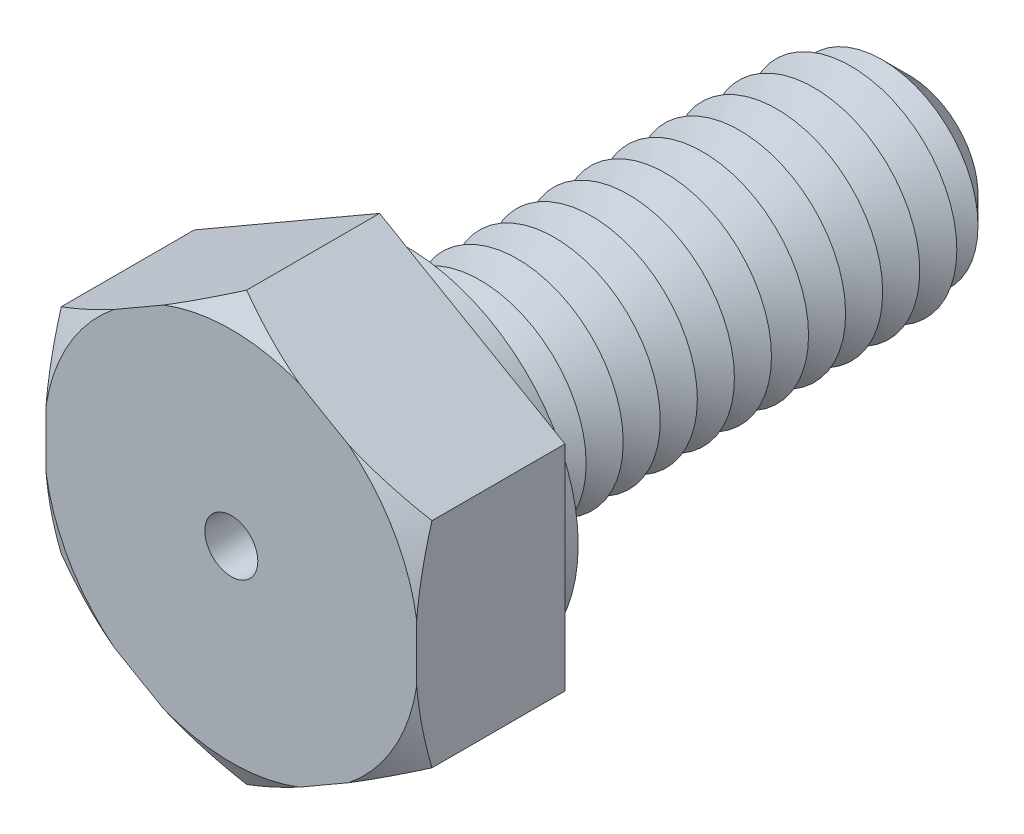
ISO-10303-21;
HEADER;
FILE_DESCRIPTION(('STEP AP214'),'2;1');
FILE_NAME('part.step','',(''),(''),'','','');
FILE_SCHEMA(('AUTOMOTIVE_DESIGN { 1 0 10303 214 1 1 1 1 }'));
ENDSEC;
DATA;
#1=APPLICATION_CONTEXT('core data for automotive mechanical design processes');
#2=APPLICATION_PROTOCOL_DEFINITION('international standard','automotive_design',2000,#1);
#3=PRODUCT_CONTEXT('',#1,'mechanical');
#4=PRODUCT('Part','Part','',(#3));
#5=PRODUCT_RELATED_PRODUCT_CATEGORY('part','',(#4));
#6=PRODUCT_DEFINITION_FORMATION('','',#4);
#7=PRODUCT_DEFINITION_CONTEXT('part definition',#1,'design');
#8=PRODUCT_DEFINITION('design','',#6,#7);
#9=PRODUCT_DEFINITION_SHAPE('','',#8);
#10=(LENGTH_UNIT() NAMED_UNIT(*) SI_UNIT(.MILLI.,.METRE.));
#11=(NAMED_UNIT(*) PLANE_ANGLE_UNIT() SI_UNIT($,.RADIAN.));
#12=(NAMED_UNIT(*) SI_UNIT($,.STERADIAN.) SOLID_ANGLE_UNIT());
#13=UNCERTAINTY_MEASURE_WITH_UNIT(LENGTH_MEASURE(1.E-05),#10,'distance_accuracy_value','');
#14=(GEOMETRIC_REPRESENTATION_CONTEXT(3) GLOBAL_UNCERTAINTY_ASSIGNED_CONTEXT((#13)) GLOBAL_UNIT_ASSIGNED_CONTEXT((#10,
#11,#12)) REPRESENTATION_CONTEXT('',''));
#15=CARTESIAN_POINT('',(0.,0.,0.));
#16=DIRECTION('',(0.,0.,1.));
#17=DIRECTION('',(1.,0.,0.));
#18=AXIS2_PLACEMENT_3D('',#15,#16,#17);
#19=CARTESIAN_POINT('',(3.5,2.02072594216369,2.8));
#20=DIRECTION('',(-0.5,-0.866025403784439,0.));
#21=DIRECTION('',(0.866025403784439,-0.5,0.));
#22=AXIS2_PLACEMENT_3D('',#19,#20,#21);
#23=PLANE('',#22);
#24=CARTESIAN_POINT('',(5.93124915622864,0.617043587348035,1.40176894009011));
#25=CARTESIAN_POINT('',(5.82127624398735,0.680536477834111,1.46111507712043));
#26=CARTESIAN_POINT('',(5.71104026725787,0.744181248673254,1.51982121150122));
#27=CARTESIAN_POINT('',(5.48993126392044,0.871838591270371,1.63565294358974));
#28=CARTESIAN_POINT('',(5.37905815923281,0.935851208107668,1.69277834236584));
#29=CARTESIAN_POINT('',(5.15623473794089,1.06449837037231,1.80531321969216));
#30=CARTESIAN_POINT('',(5.04428210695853,1.12913425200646,1.86071660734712));
#31=CARTESIAN_POINT('',(4.81953834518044,1.25889012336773,1.96920237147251));
#32=CARTESIAN_POINT('',(4.70674724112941,1.32401009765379,2.02228482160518));
#33=CARTESIAN_POINT('',(4.4773029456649,1.45647982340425,2.12693843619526));
#34=CARTESIAN_POINT('',(4.3606246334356,1.52384407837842,2.17843650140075));
#35=CARTESIAN_POINT('',(4.12610336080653,1.65924499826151,2.27776074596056));
#36=CARTESIAN_POINT('',(4.00826046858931,1.72728162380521,2.32558713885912));
#37=CARTESIAN_POINT('',(3.77136592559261,1.86405275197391,2.41666718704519));
#38=CARTESIAN_POINT('',(3.65231548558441,1.93278655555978,2.45992500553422));
#39=CARTESIAN_POINT('',(3.41281068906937,2.07106471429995,2.54086522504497));
#40=CARTESIAN_POINT('',(3.29235651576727,2.14060896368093,2.57854834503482));
#41=CARTESIAN_POINT('',(3.00433211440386,2.30689992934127,2.66006219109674));
#42=CARTESIAN_POINT('',(2.83610127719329,2.40402804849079,2.70086381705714));
#43=CARTESIAN_POINT('',(2.49725085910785,2.59966342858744,2.76622673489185));
#44=CARTESIAN_POINT('',(2.32663213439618,2.69817019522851,2.79079370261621));
#45=CARTESIAN_POINT('',(2.07079150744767,2.84587985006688,2.81342200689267));
#46=CARTESIAN_POINT('',(1.98601608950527,2.89482496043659,2.8186046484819));
#47=CARTESIAN_POINT('',(1.81634230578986,2.9927861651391,2.82423615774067));
#48=CARTESIAN_POINT('',(1.73144394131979,3.04180225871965,2.82468507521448));
#49=CARTESIAN_POINT('',(1.56172682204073,3.13978848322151,2.82082792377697));
#50=CARTESIAN_POINT('',(1.47690807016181,3.18875861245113,2.81652168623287));
#51=CARTESIAN_POINT('',(1.30753953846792,3.28654357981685,2.80328667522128));
#52=CARTESIAN_POINT('',(1.22298977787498,3.3353584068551,2.79435757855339));
#53=CARTESIAN_POINT('',(1.02330750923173,3.45064501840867,2.76803629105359));
#54=CARTESIAN_POINT('',(0.90836188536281,3.51700890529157,2.7487394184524));
#55=CARTESIAN_POINT('',(0.679569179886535,3.64910243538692,2.70286231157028));
#56=CARTESIAN_POINT('',(0.565722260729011,3.71483198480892,2.67628101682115));
#57=CARTESIAN_POINT('',(0.339141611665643,3.84564838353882,2.61683846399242));
#58=CARTESIAN_POINT('',(0.226409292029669,3.91073441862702,2.58397011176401));
#59=CARTESIAN_POINT('',(0.00220965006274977,4.04017614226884,2.512988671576));
#60=CARTESIAN_POINT('',(-0.109257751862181,4.10453187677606,2.47487591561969));
#61=CARTESIAN_POINT('',(-0.332327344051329,4.23332116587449,2.39383232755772));
#62=CARTESIAN_POINT('',(-0.443915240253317,4.29774646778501,2.35084938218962));
#63=CARTESIAN_POINT('',(-0.665905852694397,4.42591280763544,2.26126522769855));
#64=CARTESIAN_POINT('',(-0.776309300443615,4.48965426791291,2.2146664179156));
#65=CARTESIAN_POINT('',(-1.10600622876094,4.68000487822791,2.07044134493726));
#66=CARTESIAN_POINT('',(-1.32384189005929,4.80577235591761,1.96836549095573));
#67=CARTESIAN_POINT('',(-1.61545494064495,4.97413522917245,1.82536950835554));
#68=CARTESIAN_POINT('',(-1.69056073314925,5.01749757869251,1.78796601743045));
#69=CARTESIAN_POINT('',(-1.84044297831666,5.10403213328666,1.71229146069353));
#70=CARTESIAN_POINT('',(-1.91521944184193,5.14720434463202,1.67402042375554));
#71=CARTESIAN_POINT('',(-2.06368614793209,5.23292163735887,1.59712633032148));
#72=CARTESIAN_POINT('',(-2.13737951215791,5.27546852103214,1.55851128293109));
#73=CARTESIAN_POINT('',(-2.28450431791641,5.36041106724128,1.48061736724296));
#74=CARTESIAN_POINT('',(-2.35793575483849,5.40280672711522,1.44133848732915));
#75=CARTESIAN_POINT('',(-2.43124915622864,5.44513423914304,1.40176894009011));
#76=B_SPLINE_CURVE_WITH_KNOTS('',3,(#24,#25,#26,#27,#28,#29,#30,#31,#32,#33,#34,#35,#36,#37,#38,
#39,#40,#41,#42,#43,#44,#45,#46,#47,#48,#49,#50,#51,#52,#53,#54,#55,#56,#57,#58,#59,#60,#61,#62,
#63,#64,#65,#66,#67,#68,#69,#70,#71,#72,#73,#74,#75),.UNSPECIFIED.,.F.,.F.,(4,2,2,2,2,2,2,2,2,2,
2,2,2,2,2,2,2,2,2,2,2,2,2,2,2,4),(0.,0.420511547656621,0.841075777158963,1.26298883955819,
1.68488850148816,2.11755106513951,2.55018844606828,2.98242811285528,3.41461198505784,
4.0095520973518,4.60428410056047,4.89826759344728,5.19224799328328,5.48623881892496,
5.78025020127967,6.1823765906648,6.58456155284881,6.98720303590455,7.3898190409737,
7.7972442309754,8.20440134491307,9.01851321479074,9.30185450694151,9.58518638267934,
9.86552040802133,10.1458593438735),.UNSPECIFIED.);
#77=CARTESIAN_POINT('',(3.5,2.02072594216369,2.51132486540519));
#78=VERTEX_POINT('',#77);
#79=CARTESIAN_POINT('',(2.2178793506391,2.76095864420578,2.8));
#80=VERTEX_POINT('',#79);
#81=EDGE_CURVE('E132',#78,#80,#76,.T.);
#82=ORIENTED_EDGE('',*,*,#81,.F.);
#83=DIRECTION('',(0.,0.,-1.));
#84=VECTOR('',#83,1.);
#85=CARTESIAN_POINT('',(3.5,2.02072594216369,2.8));
#86=LINE('',#85,#84);
#87=CARTESIAN_POINT('',(3.5,2.02072594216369,0.));
#88=VERTEX_POINT('',#87);
#89=EDGE_CURVE('E144',#78,#88,#86,.T.);
#90=ORIENTED_EDGE('',*,*,#89,.T.);
#91=DIRECTION('',(-0.866025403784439,0.5,0.));
#92=VECTOR('',#91,1.);
#93=CARTESIAN_POINT('',(3.5,2.02072594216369,0.));
#94=LINE('',#93,#92);
#95=CARTESIAN_POINT('',(0.,4.04145188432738,0.));
#96=VERTEX_POINT('',#95);
#97=EDGE_CURVE('E307',#88,#96,#94,.T.);
#98=ORIENTED_EDGE('',*,*,#97,.T.);
#99=DIRECTION('',(0.,0.,-1.));
#100=VECTOR('',#99,1.);
#101=CARTESIAN_POINT('',(0.,4.04145188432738,2.8));
#102=LINE('',#101,#100);
#103=CARTESIAN_POINT('',(0.,4.04145188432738,2.51132486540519));
#104=VERTEX_POINT('',#103);
#105=EDGE_CURVE('E179',#104,#96,#102,.T.);
#106=ORIENTED_EDGE('',*,*,#105,.F.);
#107=CARTESIAN_POINT('',(1.2821206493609,3.30121918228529,2.8));
#108=VERTEX_POINT('',#107);
#109=EDGE_CURVE('E151',#108,#104,#76,.T.);
#110=ORIENTED_EDGE('',*,*,#109,.F.);
#111=DIRECTION('',(-0.866025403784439,0.5,0.));
#112=VECTOR('',#111,1.);
#113=CARTESIAN_POINT('',(3.5,2.02072594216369,2.8));
#114=LINE('',#113,#112);
#115=EDGE_CURVE('E148',#80,#108,#114,.T.);
#116=ORIENTED_EDGE('',*,*,#115,.F.);
#117=EDGE_LOOP('',(#82,#90,#98,#106,#110,#116));
#118=FACE_BOUND('',#117,.T.);
#119=ADVANCED_FACE('F39',(#118),#23,.F.);
#120=CARTESIAN_POINT('',(0.,4.04145188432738,2.8));
#121=DIRECTION('',(0.5,-0.866025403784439,0.));
#122=DIRECTION('',(0.866025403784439,0.5,0.));
#123=AXIS2_PLACEMENT_3D('',#120,#121,#122);
#124=PLANE('',#123);
#125=CARTESIAN_POINT('',(2.43124915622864,5.44513423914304,1.4017689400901));
#126=CARTESIAN_POINT('',(2.32127624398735,5.38164134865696,1.46111507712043));
#127=CARTESIAN_POINT('',(2.21104026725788,5.31799657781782,1.51982121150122));
#128=CARTESIAN_POINT('',(1.98993126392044,5.1903392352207,1.63565294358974));
#129=CARTESIAN_POINT('',(1.87905815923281,5.1263266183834,1.69277834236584));
#130=CARTESIAN_POINT('',(1.65623473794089,4.99767945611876,1.80531321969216));
#131=CARTESIAN_POINT('',(1.54428210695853,4.93304357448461,1.86071660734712));
#132=CARTESIAN_POINT('',(1.31953834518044,4.80328770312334,1.96920237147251));
#133=CARTESIAN_POINT('',(1.20674724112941,4.73816772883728,2.02228482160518));
#134=CARTESIAN_POINT('',(0.977302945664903,4.60569800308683,2.12693843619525));
#135=CARTESIAN_POINT('',(0.860624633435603,4.53833374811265,2.17843650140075));
#136=CARTESIAN_POINT('',(0.626103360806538,4.40293282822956,2.27776074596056));
#137=CARTESIAN_POINT('',(0.50826046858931,4.33489620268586,2.32558713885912));
#138=CARTESIAN_POINT('',(0.271365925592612,4.19812507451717,2.41666718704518));
#139=CARTESIAN_POINT('',(0.152315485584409,4.12939127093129,2.45992500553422));
#140=CARTESIAN_POINT('',(-0.0871893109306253,3.99111311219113,2.54086522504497));
#141=CARTESIAN_POINT('',(-0.207643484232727,3.92156886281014,2.57854834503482));
#142=CARTESIAN_POINT('',(-0.495667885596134,3.7552778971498,2.66006219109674));
#143=CARTESIAN_POINT('',(-0.663898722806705,3.65814977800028,2.70086381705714));
#144=CARTESIAN_POINT('',(-1.00274914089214,3.46251439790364,2.76622673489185));
#145=CARTESIAN_POINT('',(-1.17336786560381,3.36400763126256,2.79079370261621));
#146=CARTESIAN_POINT('',(-1.42920849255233,3.21629797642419,2.81342200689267));
#147=CARTESIAN_POINT('',(-1.51398391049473,3.16735286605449,2.8186046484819));
#148=CARTESIAN_POINT('',(-1.68365769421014,3.06939166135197,2.82423615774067));
#149=CARTESIAN_POINT('',(-1.7685560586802,3.02037556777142,2.82468507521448));
#150=CARTESIAN_POINT('',(-1.93827317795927,2.92238934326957,2.82082792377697));
#151=CARTESIAN_POINT('',(-2.02309192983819,2.87341921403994,2.81652168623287));
#152=CARTESIAN_POINT('',(-2.19246046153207,2.77563424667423,2.80328667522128));
#153=CARTESIAN_POINT('',(-2.27701022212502,2.72681941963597,2.79435757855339));
#154=CARTESIAN_POINT('',(-2.47669249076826,2.6115328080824,2.76803629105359));
#155=CARTESIAN_POINT('',(-2.59163811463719,2.54516892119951,2.7487394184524));
#156=CARTESIAN_POINT('',(-2.82043082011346,2.41307539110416,2.70286231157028));
#157=CARTESIAN_POINT('',(-2.93427773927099,2.34734584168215,2.67628101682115));
#158=CARTESIAN_POINT('',(-3.16085838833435,2.21652944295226,2.61683846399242));
#159=CARTESIAN_POINT('',(-3.27359070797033,2.15144340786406,2.58397011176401));
#160=CARTESIAN_POINT('',(-3.49779034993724,2.02200168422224,2.512988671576));
#161=CARTESIAN_POINT('',(-3.60925775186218,1.95764594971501,2.47487591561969));
#162=CARTESIAN_POINT('',(-3.83232734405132,1.82885666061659,2.39383232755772));
#163=CARTESIAN_POINT('',(-3.94391524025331,1.76443135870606,2.35084938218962));
#164=CARTESIAN_POINT('',(-4.16590585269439,1.63626501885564,2.26126522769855));
#165=CARTESIAN_POINT('',(-4.27630930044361,1.57252355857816,2.21466641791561));
#166=CARTESIAN_POINT('',(-4.60600622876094,1.38217294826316,2.07044134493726));
#167=CARTESIAN_POINT('',(-4.82384189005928,1.25640547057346,1.96836549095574));
#168=CARTESIAN_POINT('',(-5.11545494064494,1.08804259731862,1.82536950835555));
#169=CARTESIAN_POINT('',(-5.19056073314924,1.04468024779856,1.78796601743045));
#170=CARTESIAN_POINT('',(-5.34044297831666,0.958145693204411,1.71229146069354));
#171=CARTESIAN_POINT('',(-5.41521944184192,0.914973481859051,1.67402042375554));
#172=CARTESIAN_POINT('',(-5.56368614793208,0.829256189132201,1.59712633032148));
#173=CARTESIAN_POINT('',(-5.6373795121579,0.786709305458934,1.55851128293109));
#174=CARTESIAN_POINT('',(-5.78450431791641,0.701766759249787,1.48061736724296));
#175=CARTESIAN_POINT('',(-5.85793575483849,0.659371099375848,1.44133848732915));
#176=CARTESIAN_POINT('',(-5.93124915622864,0.617043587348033,1.40176894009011));
#177=B_SPLINE_CURVE_WITH_KNOTS('',3,(#125,#126,#127,#128,#129,#130,#131,#132,#133,#134,#135,
#136,#137,#138,#139,#140,#141,#142,#143,#144,#145,#146,#147,#148,#149,#150,#151,#152,#153,#154,
#155,#156,#157,#158,#159,#160,#161,#162,#163,#164,#165,#166,#167,#168,#169,#170,#171,#172,#173,
#174,#175,#176),.UNSPECIFIED.,.F.,.F.,(4,2,2,2,2,2,2,2,2,2,2,2,2,2,2,2,2,2,2,2,2,2,2,2,2,4),(0.,
0.420511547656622,0.841075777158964,1.26298883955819,1.68488850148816,2.11755106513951,
2.55018844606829,2.98242811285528,3.41461198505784,4.0095520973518,4.60428410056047,
4.89826759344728,5.19224799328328,5.48623881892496,5.78025020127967,6.1823765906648,
6.58456155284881,6.98720303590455,7.3898190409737,7.7972442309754,8.20440134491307,
9.01851321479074,9.30185450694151,9.58518638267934,9.86552040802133,10.1458593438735),.UNSPECIFIED.);
#178=CARTESIAN_POINT('',(-1.2821206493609,3.30121918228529,2.8));
#179=VERTEX_POINT('',#178);
#180=EDGE_CURVE('E899',#104,#179,#177,.T.);
#181=ORIENTED_EDGE('',*,*,#180,.F.);
#182=ORIENTED_EDGE('',*,*,#105,.T.);
#183=DIRECTION('',(-0.866025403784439,-0.5,0.));
#184=VECTOR('',#183,1.);
#185=CARTESIAN_POINT('',(0.,4.04145188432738,0.));
#186=LINE('',#185,#184);
#187=CARTESIAN_POINT('',(-3.5,2.02072594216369,0.));
#188=VERTEX_POINT('',#187);
#189=EDGE_CURVE('E326',#96,#188,#186,.T.);
#190=ORIENTED_EDGE('',*,*,#189,.T.);
#191=DIRECTION('',(0.,0.,-1.));
#192=VECTOR('',#191,1.);
#193=CARTESIAN_POINT('',(-3.5,2.02072594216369,2.8));
#194=LINE('',#193,#192);
#195=CARTESIAN_POINT('',(-3.5,2.02072594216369,2.51132486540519));
#196=VERTEX_POINT('',#195);
#197=EDGE_CURVE('E176',#196,#188,#194,.T.);
#198=ORIENTED_EDGE('',*,*,#197,.F.);
#199=CARTESIAN_POINT('',(-2.2178793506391,2.76095864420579,2.8));
#200=VERTEX_POINT('',#199);
#201=EDGE_CURVE('E394',#200,#196,#177,.T.);
#202=ORIENTED_EDGE('',*,*,#201,.F.);
#203=DIRECTION('',(-0.866025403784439,-0.5,0.));
#204=VECTOR('',#203,1.);
#205=CARTESIAN_POINT('',(0.,4.04145188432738,2.8));
#206=LINE('',#205,#204);
#207=EDGE_CURVE('E310',#179,#200,#206,.T.);
#208=ORIENTED_EDGE('',*,*,#207,.F.);
#209=EDGE_LOOP('',(#181,#182,#190,#198,#202,#208));
#210=FACE_BOUND('',#209,.T.);
#211=ADVANCED_FACE('F403',(#210),#124,.F.);
#212=CARTESIAN_POINT('',(-3.5,2.02072594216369,2.8));
#213=DIRECTION('',(1.,0.,0.));
#214=DIRECTION('',(0.,1.,0.));
#215=AXIS2_PLACEMENT_3D('',#212,#213,#214);
#216=PLANE('',#215);
#217=CARTESIAN_POINT('',(-3.5,4.45197509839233,1.57509745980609));
#218=CARTESIAN_POINT('',(-3.5,4.32552348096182,1.632476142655));
#219=CARTESIAN_POINT('',(-3.5,4.19872625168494,1.68910722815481));
#220=CARTESIAN_POINT('',(-3.5,3.94429210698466,1.80051165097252));
#221=CARTESIAN_POINT('',(-3.5,3.81665504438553,1.85528465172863));
#222=CARTESIAN_POINT('',(-3.5,3.55990351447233,1.96281335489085));
#223=CARTESIAN_POINT('',(-3.5,3.43078510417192,2.01555968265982));
#224=CARTESIAN_POINT('',(-3.5,3.17145843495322,2.11829034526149));
#225=CARTESIAN_POINT('',(-3.5,3.04125022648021,2.16827480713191));
#226=CARTESIAN_POINT('',(-3.5,2.78016103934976,2.26465408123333));
#227=CARTESIAN_POINT('',(-3.5,2.64928566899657,2.31106393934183));
#228=CARTESIAN_POINT('',(-3.5,2.38615329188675,2.39977727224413));
#229=CARTESIAN_POINT('',(-3.5,2.25389619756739,2.44208048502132));
#230=CARTESIAN_POINT('',(-3.5,1.85519063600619,2.56138283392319));
#231=CARTESIAN_POINT('',(-3.5,1.58637912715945,2.63093897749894));
#232=CARTESIAN_POINT('',(-3.5,1.11975855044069,2.72563856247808));
#233=CARTESIAN_POINT('',(-3.5,0.923391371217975,2.75778053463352));
#234=CARTESIAN_POINT('',(-3.5,0.528527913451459,2.80406409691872));
#235=CARTESIAN_POINT('',(-3.5,0.330032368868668,2.81821170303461));
#236=CARTESIAN_POINT('',(-3.5,-0.0672968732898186,2.82680706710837));
#237=CARTESIAN_POINT('',(-3.5,-0.266130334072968,2.82126532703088));
#238=CARTESIAN_POINT('',(-3.5,-0.662321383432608,2.79120496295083));
#239=CARTESIAN_POINT('',(-3.5,-0.859678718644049,2.76668315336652));
#240=CARTESIAN_POINT('',(-3.5,-1.34971804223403,2.68500356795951));
#241=CARTESIAN_POINT('',(-3.5,-1.64068160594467,2.61765497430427));
#242=CARTESIAN_POINT('',(-3.5,-2.07181303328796,2.497569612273));
#243=CARTESIAN_POINT('',(-3.5,-2.21482517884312,2.45429352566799));
#244=CARTESIAN_POINT('',(-3.5,-2.49919378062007,2.36258423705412));
#245=CARTESIAN_POINT('',(-3.5,-2.64055035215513,2.31415139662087));
#246=CARTESIAN_POINT('',(-3.5,-2.92337235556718,2.2125676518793));
#247=CARTESIAN_POINT('',(-3.5,-3.06482042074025,2.15936898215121));
#248=CARTESIAN_POINT('',(-3.5,-3.34639535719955,2.04956763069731));
#249=CARTESIAN_POINT('',(-3.5,-3.48652214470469,1.99296473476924));
#250=CARTESIAN_POINT('',(-3.5,-3.76476497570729,1.87738368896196));
#251=CARTESIAN_POINT('',(-3.5,-3.90288810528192,1.81842250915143));
#252=CARTESIAN_POINT('',(-3.5,-4.1781332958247,1.6982956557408));
#253=CARTESIAN_POINT('',(-3.5,-4.31525559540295,1.6371305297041));
#254=CARTESIAN_POINT('',(-3.5,-4.45197509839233,1.57509745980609));
#255=B_SPLINE_CURVE_WITH_KNOTS('',3,(#217,#218,#219,#220,#221,#222,#223,#224,#225,#226,#227,
#228,#229,#230,#231,#232,#233,#234,#235,#236,#237,#238,#239,#240,#241,#242,#243,#244,#245,#246,
#247,#248,#249,#250,#251,#252,#253,#254),.UNSPECIFIED.,.F.,.F.,(4,2,2,2,2,2,2,2,2,2,2,2,2,2,2,2,
2,2,4),(0.,0.416588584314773,0.83325222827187,1.251655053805,1.67003861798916,2.08655215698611,
2.50309225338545,3.3347974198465,3.93106101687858,4.52712521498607,5.12287153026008,
5.71871785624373,6.61272902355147,7.06093271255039,7.50910499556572,7.9624204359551,
8.41576442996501,8.86628772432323,9.31669984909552),.UNSPECIFIED.);
#256=CARTESIAN_POINT('',(-3.5,0.540260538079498,2.8));
#257=VERTEX_POINT('',#256);
#258=EDGE_CURVE('E393',#196,#257,#255,.T.);
#259=ORIENTED_EDGE('',*,*,#258,.F.);
#260=ORIENTED_EDGE('',*,*,#197,.T.);
#261=DIRECTION('',(0.,-1.,0.));
#262=VECTOR('',#261,1.);
#263=CARTESIAN_POINT('',(-3.5,2.02072594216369,0.));
#264=LINE('',#263,#262);
#265=CARTESIAN_POINT('',(-3.5,-2.02072594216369,0.));
#266=VERTEX_POINT('',#265);
#267=EDGE_CURVE('E330',#188,#266,#264,.T.);
#268=ORIENTED_EDGE('',*,*,#267,.T.);
#269=DIRECTION('',(0.,0.,-1.));
#270=VECTOR('',#269,1.);
#271=CARTESIAN_POINT('',(-3.5,-2.02072594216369,2.8));
#272=LINE('',#271,#270);
#273=CARTESIAN_POINT('',(-3.5,-2.02072594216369,2.51132486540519));
#274=VERTEX_POINT('',#273);
#275=EDGE_CURVE('E173',#274,#266,#272,.T.);
#276=ORIENTED_EDGE('',*,*,#275,.F.);
#277=CARTESIAN_POINT('',(-3.5,-0.540260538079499,2.8));
#278=VERTEX_POINT('',#277);
#279=EDGE_CURVE('E387',#278,#274,#255,.T.);
#280=ORIENTED_EDGE('',*,*,#279,.F.);
#281=DIRECTION('',(0.,-1.,0.));
#282=VECTOR('',#281,1.);
#283=CARTESIAN_POINT('',(-3.5,2.02072594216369,2.8));
#284=LINE('',#283,#282);
#285=EDGE_CURVE('E314',#257,#278,#284,.T.);
#286=ORIENTED_EDGE('',*,*,#285,.F.);
#287=EDGE_LOOP('',(#259,#260,#268,#276,#280,#286));
#288=FACE_BOUND('',#287,.T.);
#289=ADVANCED_FACE('F399',(#288),#216,.F.);
#290=CARTESIAN_POINT('',(-3.5,-2.02072594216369,2.8));
#291=DIRECTION('',(0.5,0.866025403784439,0.));
#292=DIRECTION('',(-0.866025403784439,0.5,0.));
#293=AXIS2_PLACEMENT_3D('',#290,#291,#292);
#294=PLANE('',#293);
#295=CARTESIAN_POINT('',(-5.93124915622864,-0.617043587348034,1.4017689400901));
#296=CARTESIAN_POINT('',(-5.82127624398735,-0.68053647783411,1.46111507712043));
#297=CARTESIAN_POINT('',(-5.71104026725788,-0.744181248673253,1.51982121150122));
#298=CARTESIAN_POINT('',(-5.48993126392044,-0.87183859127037,1.63565294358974));
#299=CARTESIAN_POINT('',(-5.37905815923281,-0.935851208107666,1.69277834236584));
#300=CARTESIAN_POINT('',(-5.15623473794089,-1.06449837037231,1.80531321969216));
#301=CARTESIAN_POINT('',(-5.04428210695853,-1.12913425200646,1.86071660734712));
#302=CARTESIAN_POINT('',(-4.81953834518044,-1.25889012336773,1.96920237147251));
#303=CARTESIAN_POINT('',(-4.70674724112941,-1.32401009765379,2.02228482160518));
#304=CARTESIAN_POINT('',(-4.4773029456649,-1.45647982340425,2.12693843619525));
#305=CARTESIAN_POINT('',(-4.3606246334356,-1.52384407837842,2.17843650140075));
#306=CARTESIAN_POINT('',(-4.12610336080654,-1.65924499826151,2.27776074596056));
#307=CARTESIAN_POINT('',(-4.00826046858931,-1.72728162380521,2.32558713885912));
#308=CARTESIAN_POINT('',(-3.77136592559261,-1.8640527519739,2.41666718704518));
#309=CARTESIAN_POINT('',(-3.65231548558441,-1.93278655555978,2.45992500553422));
#310=CARTESIAN_POINT('',(-3.41281068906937,-2.07106471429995,2.54086522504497));
#311=CARTESIAN_POINT('',(-3.29235651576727,-2.14060896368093,2.57854834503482));
#312=CARTESIAN_POINT('',(-3.00433211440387,-2.30689992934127,2.66006219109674));
#313=CARTESIAN_POINT('',(-2.83610127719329,-2.40402804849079,2.70086381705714));
#314=CARTESIAN_POINT('',(-2.49725085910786,-2.59966342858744,2.76622673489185));
#315=CARTESIAN_POINT('',(-2.32663213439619,-2.69817019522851,2.79079370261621));
#316=CARTESIAN_POINT('',(-2.07079150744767,-2.84587985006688,2.81342200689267));
#317=CARTESIAN_POINT('',(-1.98601608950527,-2.89482496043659,2.8186046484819));
#318=CARTESIAN_POINT('',(-1.81634230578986,-2.9927861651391,2.82423615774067));
#319=CARTESIAN_POINT('',(-1.7314439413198,-3.04180225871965,2.82468507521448));
#320=CARTESIAN_POINT('',(-1.56172682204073,-3.13978848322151,2.82082792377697));
#321=CARTESIAN_POINT('',(-1.47690807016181,-3.18875861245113,2.81652168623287));
#322=CARTESIAN_POINT('',(-1.30753953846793,-3.28654357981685,2.80328667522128));
#323=CARTESIAN_POINT('',(-1.22298977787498,-3.3353584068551,2.79435757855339));
#324=CARTESIAN_POINT('',(-1.02330750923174,-3.45064501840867,2.76803629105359));
#325=CARTESIAN_POINT('',(-0.908361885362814,-3.51700890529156,2.7487394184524));
#326=CARTESIAN_POINT('',(-0.679569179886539,-3.64910243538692,2.70286231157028));
#327=CARTESIAN_POINT('',(-0.565722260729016,-3.71483198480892,2.67628101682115));
#328=CARTESIAN_POINT('',(-0.339141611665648,-3.84564838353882,2.61683846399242));
#329=CARTESIAN_POINT('',(-0.226409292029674,-3.91073441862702,2.58397011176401));
#330=CARTESIAN_POINT('',(-0.00220965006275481,-4.04017614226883,2.512988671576));
#331=CARTESIAN_POINT('',(0.109257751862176,-4.10453187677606,2.47487591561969));
#332=CARTESIAN_POINT('',(0.332327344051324,-4.23332116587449,2.39383232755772));
#333=CARTESIAN_POINT('',(0.443915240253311,-4.29774646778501,2.35084938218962));
#334=CARTESIAN_POINT('',(0.665905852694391,-4.42591280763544,2.26126522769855));
#335=CARTESIAN_POINT('',(0.776309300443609,-4.48965426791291,2.2146664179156));
#336=CARTESIAN_POINT('',(1.10600622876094,-4.68000487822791,2.07044134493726));
#337=CARTESIAN_POINT('',(1.32384189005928,-4.80577235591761,1.96836549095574));
#338=CARTESIAN_POINT('',(1.61545494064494,-4.97413522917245,1.82536950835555));
#339=CARTESIAN_POINT('',(1.69056073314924,-5.01749757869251,1.78796601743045));
#340=CARTESIAN_POINT('',(1.84044297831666,-5.10403213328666,1.71229146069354));
#341=CARTESIAN_POINT('',(1.91521944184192,-5.14720434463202,1.67402042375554));
#342=CARTESIAN_POINT('',(2.06368614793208,-5.23292163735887,1.59712633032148));
#343=CARTESIAN_POINT('',(2.1373795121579,-5.27546852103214,1.55851128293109));
#344=CARTESIAN_POINT('',(2.28450431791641,-5.36041106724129,1.48061736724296));
#345=CARTESIAN_POINT('',(2.35793575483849,-5.40280672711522,1.44133848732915));
#346=CARTESIAN_POINT('',(2.43124915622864,-5.44513423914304,1.40176894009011));
#347=B_SPLINE_CURVE_WITH_KNOTS('',3,(#295,#296,#297,#298,#299,#300,#301,#302,#303,#304,#305,
#306,#307,#308,#309,#310,#311,#312,#313,#314,#315,#316,#317,#318,#319,#320,#321,#322,#323,#324,
#325,#326,#327,#328,#329,#330,#331,#332,#333,#334,#335,#336,#337,#338,#339,#340,#341,#342,#343,
#344,#345,#346),.UNSPECIFIED.,.F.,.F.,(4,2,2,2,2,2,2,2,2,2,2,2,2,2,2,2,2,2,2,2,2,2,2,2,2,4),(0.,
0.420511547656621,0.841075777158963,1.26298883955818,1.68488850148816,2.11755106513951,
2.55018844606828,2.98242811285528,3.41461198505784,4.00955209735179,4.60428410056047,
4.89826759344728,5.19224799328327,5.48623881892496,5.78025020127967,6.1823765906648,
6.58456155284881,6.98720303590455,7.38981904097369,7.7972442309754,8.20440134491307,
9.01851321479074,9.30185450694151,9.58518638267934,9.86552040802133,10.1458593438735),.UNSPECIFIED.);
#348=CARTESIAN_POINT('',(-2.2178793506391,-2.76095864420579,2.8));
#349=VERTEX_POINT('',#348);
#350=EDGE_CURVE('E346',#274,#349,#347,.T.);
#351=ORIENTED_EDGE('',*,*,#350,.F.);
#352=ORIENTED_EDGE('',*,*,#275,.T.);
#353=DIRECTION('',(0.866025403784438,-0.5,0.));
#354=VECTOR('',#353,1.);
#355=CARTESIAN_POINT('',(-3.5,-2.02072594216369,0.));
#356=LINE('',#355,#354);
#357=CARTESIAN_POINT('',(0.,-4.04145188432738,0.));
#358=VERTEX_POINT('',#357);
#359=EDGE_CURVE('E334',#266,#358,#356,.T.);
#360=ORIENTED_EDGE('',*,*,#359,.T.);
#361=DIRECTION('',(0.,0.,-1.));
#362=VECTOR('',#361,1.);
#363=CARTESIAN_POINT('',(0.,-4.04145188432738,2.8));
#364=LINE('',#363,#362);
#365=CARTESIAN_POINT('',(0.,-4.04145188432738,2.51132486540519));
#366=VERTEX_POINT('',#365);
#367=EDGE_CURVE('E163',#366,#358,#364,.T.);
#368=ORIENTED_EDGE('',*,*,#367,.F.);
#369=CARTESIAN_POINT('',(-1.2821206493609,-3.30121918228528,2.8));
#370=VERTEX_POINT('',#369);
#371=EDGE_CURVE('E345',#370,#366,#347,.T.);
#372=ORIENTED_EDGE('',*,*,#371,.F.);
#373=DIRECTION('',(0.866025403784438,-0.5,0.));
#374=VECTOR('',#373,1.);
#375=CARTESIAN_POINT('',(-3.5,-2.02072594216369,2.8));
#376=LINE('',#375,#374);
#377=EDGE_CURVE('E318',#349,#370,#376,.T.);
#378=ORIENTED_EDGE('',*,*,#377,.F.);
#379=EDGE_LOOP('',(#351,#352,#360,#368,#372,#378));
#380=FACE_BOUND('',#379,.T.);
#381=ADVANCED_FACE('F402',(#380),#294,.F.);
#382=CARTESIAN_POINT('',(0.,-4.04145188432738,2.8));
#383=DIRECTION('',(-0.5,0.866025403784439,0.));
#384=DIRECTION('',(-0.866025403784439,-0.5,0.));
#385=AXIS2_PLACEMENT_3D('',#382,#383,#384);
#386=PLANE('',#385);
#387=CARTESIAN_POINT('',(-2.43124915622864,-5.44513423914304,1.4017689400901));
#388=CARTESIAN_POINT('',(-2.32127624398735,-5.38164134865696,1.46111507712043));
#389=CARTESIAN_POINT('',(-2.21104026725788,-5.31799657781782,1.51982121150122));
#390=CARTESIAN_POINT('',(-1.98993126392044,-5.1903392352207,1.63565294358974));
#391=CARTESIAN_POINT('',(-1.87905815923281,-5.1263266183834,1.69277834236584));
#392=CARTESIAN_POINT('',(-1.65623473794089,-4.99767945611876,1.80531321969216));
#393=CARTESIAN_POINT('',(-1.54428210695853,-4.93304357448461,1.86071660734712));
#394=CARTESIAN_POINT('',(-1.31953834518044,-4.80328770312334,1.96920237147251));
#395=CARTESIAN_POINT('',(-1.20674724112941,-4.73816772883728,2.02228482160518));
#396=CARTESIAN_POINT('',(-0.977302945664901,-4.60569800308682,2.12693843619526));
#397=CARTESIAN_POINT('',(-0.860624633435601,-4.53833374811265,2.17843650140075));
#398=CARTESIAN_POINT('',(-0.626103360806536,-4.40293282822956,2.27776074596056));
#399=CARTESIAN_POINT('',(-0.508260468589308,-4.33489620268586,2.32558713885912));
#400=CARTESIAN_POINT('',(-0.27136592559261,-4.19812507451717,2.41666718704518));
#401=CARTESIAN_POINT('',(-0.152315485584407,-4.12939127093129,2.45992500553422));
#402=CARTESIAN_POINT('',(0.0871893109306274,-3.99111311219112,2.54086522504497));
#403=CARTESIAN_POINT('',(0.20764348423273,-3.92156886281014,2.57854834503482));
#404=CARTESIAN_POINT('',(0.495667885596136,-3.7552778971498,2.66006219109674));
#405=CARTESIAN_POINT('',(0.663898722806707,-3.65814977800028,2.70086381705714));
#406=CARTESIAN_POINT('',(1.00274914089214,-3.46251439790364,2.76622673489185));
#407=CARTESIAN_POINT('',(1.17336786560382,-3.36400763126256,2.79079370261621));
#408=CARTESIAN_POINT('',(1.42920849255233,-3.21629797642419,2.81342200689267));
#409=CARTESIAN_POINT('',(1.51398391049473,-3.16735286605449,2.8186046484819));
#410=CARTESIAN_POINT('',(1.68365769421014,-3.06939166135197,2.82423615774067));
#411=CARTESIAN_POINT('',(1.76855605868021,-3.02037556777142,2.82468507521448));
#412=CARTESIAN_POINT('',(1.93827317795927,-2.92238934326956,2.82082792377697));
#413=CARTESIAN_POINT('',(2.02309192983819,-2.87341921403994,2.81652168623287));
#414=CARTESIAN_POINT('',(2.19246046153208,-2.77563424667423,2.80328667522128));
#415=CARTESIAN_POINT('',(2.27701022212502,-2.72681941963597,2.79435757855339));
#416=CARTESIAN_POINT('',(2.47669249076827,-2.6115328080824,2.76803629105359));
#417=CARTESIAN_POINT('',(2.59163811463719,-2.54516892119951,2.7487394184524));
#418=CARTESIAN_POINT('',(2.82043082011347,-2.41307539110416,2.70286231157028));
#419=CARTESIAN_POINT('',(2.93427773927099,-2.34734584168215,2.67628101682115));
#420=CARTESIAN_POINT('',(3.16085838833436,-2.21652944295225,2.61683846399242));
#421=CARTESIAN_POINT('',(3.27359070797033,-2.15144340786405,2.58397011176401));
#422=CARTESIAN_POINT('',(3.49779034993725,-2.02200168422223,2.512988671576));
#423=CARTESIAN_POINT('',(3.60925775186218,-1.95764594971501,2.47487591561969));
#424=CARTESIAN_POINT('',(3.83232734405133,-1.82885666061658,2.39383232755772));
#425=CARTESIAN_POINT('',(3.94391524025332,-1.76443135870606,2.35084938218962));
#426=CARTESIAN_POINT('',(4.1659058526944,-1.63626501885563,2.26126522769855));
#427=CARTESIAN_POINT('',(4.27630930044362,-1.57252355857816,2.2146664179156));
#428=CARTESIAN_POINT('',(4.60600622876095,-1.38217294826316,2.07044134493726));
#429=CARTESIAN_POINT('',(4.82384189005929,-1.25640547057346,1.96836549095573));
#430=CARTESIAN_POINT('',(5.11545494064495,-1.08804259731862,1.82536950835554));
#431=CARTESIAN_POINT('',(5.19056073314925,-1.04468024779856,1.78796601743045));
#432=CARTESIAN_POINT('',(5.34044297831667,-0.95814569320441,1.71229146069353));
#433=CARTESIAN_POINT('',(5.41521944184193,-0.914973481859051,1.67402042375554));
#434=CARTESIAN_POINT('',(5.56368614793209,-0.829256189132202,1.59712633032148));
#435=CARTESIAN_POINT('',(5.63737951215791,-0.786709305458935,1.55851128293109));
#436=CARTESIAN_POINT('',(5.78450431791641,-0.70176675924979,1.48061736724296));
#437=CARTESIAN_POINT('',(5.85793575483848,-0.659371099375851,1.44133848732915));
#438=CARTESIAN_POINT('',(5.93124915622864,-0.617043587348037,1.40176894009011));
#439=B_SPLINE_CURVE_WITH_KNOTS('',3,(#387,#388,#389,#390,#391,#392,#393,#394,#395,#396,#397,
#398,#399,#400,#401,#402,#403,#404,#405,#406,#407,#408,#409,#410,#411,#412,#413,#414,#415,#416,
#417,#418,#419,#420,#421,#422,#423,#424,#425,#426,#427,#428,#429,#430,#431,#432,#433,#434,#435,
#436,#437,#438),.UNSPECIFIED.,.F.,.F.,(4,2,2,2,2,2,2,2,2,2,2,2,2,2,2,2,2,2,2,2,2,2,2,2,2,4),(0.,
0.420511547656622,0.841075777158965,1.26298883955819,1.68488850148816,2.11755106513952,
2.55018844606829,2.98242811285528,3.41461198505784,4.0095520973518,4.60428410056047,
4.89826759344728,5.19224799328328,5.48623881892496,5.78025020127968,6.18237659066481,
6.58456155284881,6.98720303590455,7.3898190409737,7.79724423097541,8.20440134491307,
9.01851321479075,9.30185450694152,9.58518638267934,9.86552040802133,10.1458593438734),.UNSPECIFIED.);
#440=CARTESIAN_POINT('',(1.2821206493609,-3.30121918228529,2.8));
#441=VERTEX_POINT('',#440);
#442=EDGE_CURVE('E64',#366,#441,#439,.T.);
#443=ORIENTED_EDGE('',*,*,#442,.F.);
#444=ORIENTED_EDGE('',*,*,#367,.T.);
#445=DIRECTION('',(0.866025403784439,0.5,0.));
#446=VECTOR('',#445,1.);
#447=CARTESIAN_POINT('',(0.,-4.04145188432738,0.));
#448=LINE('',#447,#446);
#449=CARTESIAN_POINT('',(3.5,-2.02072594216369,0.));
#450=VERTEX_POINT('',#449);
#451=EDGE_CURVE('E337',#358,#450,#448,.T.);
#452=ORIENTED_EDGE('',*,*,#451,.T.);
#453=DIRECTION('',(0.,0.,-1.));
#454=VECTOR('',#453,1.);
#455=CARTESIAN_POINT('',(3.5,-2.02072594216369,2.8));
#456=LINE('',#455,#454);
#457=CARTESIAN_POINT('',(3.5,-2.02072594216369,2.51132486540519));
#458=VERTEX_POINT('',#457);
#459=EDGE_CURVE('E157',#458,#450,#456,.T.);
#460=ORIENTED_EDGE('',*,*,#459,.F.);
#461=CARTESIAN_POINT('',(2.2178793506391,-2.76095864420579,2.8));
#462=VERTEX_POINT('',#461);
#463=EDGE_CURVE('E348',#462,#458,#439,.T.);
#464=ORIENTED_EDGE('',*,*,#463,.F.);
#465=DIRECTION('',(0.866025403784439,0.5,0.));
#466=VECTOR('',#465,1.);
#467=CARTESIAN_POINT('',(0.,-4.04145188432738,2.8));
#468=LINE('',#467,#466);
#469=EDGE_CURVE('E166',#441,#462,#468,.T.);
#470=ORIENTED_EDGE('',*,*,#469,.F.);
#471=EDGE_LOOP('',(#443,#444,#452,#460,#464,#470));
#472=FACE_BOUND('',#471,.T.);
#473=ADVANCED_FACE('F424',(#472),#386,.F.);
#474=CARTESIAN_POINT('',(3.5,-2.02072594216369,2.8));
#475=DIRECTION('',(-1.,0.,0.));
#476=DIRECTION('',(0.,-1.,0.));
#477=AXIS2_PLACEMENT_3D('',#474,#475,#476);
#478=PLANE('',#477);
#479=CARTESIAN_POINT('',(3.5,-4.45197509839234,1.57509745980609));
#480=CARTESIAN_POINT('',(3.5,-4.32552348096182,1.632476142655));
#481=CARTESIAN_POINT('',(3.5,-4.19872625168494,1.68910722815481));
#482=CARTESIAN_POINT('',(3.5,-3.94429210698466,1.80051165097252));
#483=CARTESIAN_POINT('',(3.5,-3.81665504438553,1.85528465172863));
#484=CARTESIAN_POINT('',(3.5,-3.55990351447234,1.96281335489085));
#485=CARTESIAN_POINT('',(3.5,-3.43078510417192,2.01555968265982));
#486=CARTESIAN_POINT('',(3.5,-3.17145843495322,2.11829034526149));
#487=CARTESIAN_POINT('',(3.5,-3.04125022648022,2.16827480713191));
#488=CARTESIAN_POINT('',(3.5,-2.78016103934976,2.26465408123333));
#489=CARTESIAN_POINT('',(3.5,-2.64928566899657,2.31106393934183));
#490=CARTESIAN_POINT('',(3.5,-2.38615329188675,2.39977727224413));
#491=CARTESIAN_POINT('',(3.5,-2.25389619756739,2.44208048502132));
#492=CARTESIAN_POINT('',(3.5,-1.85519063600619,2.56138283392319));
#493=CARTESIAN_POINT('',(3.5,-1.58637912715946,2.63093897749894));
#494=CARTESIAN_POINT('',(3.5,-1.11975855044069,2.72563856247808));
#495=CARTESIAN_POINT('',(3.5,-0.923391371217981,2.75778053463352));
#496=CARTESIAN_POINT('',(3.5,-0.528527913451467,2.80406409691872));
#497=CARTESIAN_POINT('',(3.5,-0.330032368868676,2.81821170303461));
#498=CARTESIAN_POINT('',(3.5,0.0672968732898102,2.82680706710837));
#499=CARTESIAN_POINT('',(3.5,0.26613033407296,2.82126532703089));
#500=CARTESIAN_POINT('',(3.5,0.662321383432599,2.79120496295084));
#501=CARTESIAN_POINT('',(3.5,0.85967871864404,2.76668315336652));
#502=CARTESIAN_POINT('',(3.5,1.34971804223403,2.68500356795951));
#503=CARTESIAN_POINT('',(3.5,1.64068160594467,2.61765497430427));
#504=CARTESIAN_POINT('',(3.5,2.07181303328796,2.497569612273));
#505=CARTESIAN_POINT('',(3.5,2.21482517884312,2.45429352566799));
#506=CARTESIAN_POINT('',(3.5,2.49919378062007,2.36258423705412));
#507=CARTESIAN_POINT('',(3.5,2.64055035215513,2.31415139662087));
#508=CARTESIAN_POINT('',(3.5,2.92337235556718,2.2125676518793));
#509=CARTESIAN_POINT('',(3.5,3.06482042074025,2.15936898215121));
#510=CARTESIAN_POINT('',(3.5,3.34639535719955,2.04956763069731));
#511=CARTESIAN_POINT('',(3.5,3.48652214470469,1.99296473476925));
#512=CARTESIAN_POINT('',(3.5,3.76476497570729,1.87738368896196));
#513=CARTESIAN_POINT('',(3.5,3.90288810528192,1.81842250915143));
#514=CARTESIAN_POINT('',(3.5,4.1781332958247,1.6982956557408));
#515=CARTESIAN_POINT('',(3.5,4.31525559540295,1.6371305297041));
#516=CARTESIAN_POINT('',(3.5,4.45197509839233,1.57509745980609));
#517=B_SPLINE_CURVE_WITH_KNOTS('',3,(#479,#480,#481,#482,#483,#484,#485,#486,#487,#488,#489,
#490,#491,#492,#493,#494,#495,#496,#497,#498,#499,#500,#501,#502,#503,#504,#505,#506,#507,#508,
#509,#510,#511,#512,#513,#514,#515,#516),.UNSPECIFIED.,.F.,.F.,(4,2,2,2,2,2,2,2,2,2,2,2,2,2,2,2,
2,2,4),(0.,0.416588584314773,0.83325222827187,1.251655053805,1.67003861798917,2.08655215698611,
2.50309225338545,3.33479741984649,3.93106101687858,4.52712521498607,5.12287153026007,
5.71871785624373,6.61272902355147,7.0609327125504,7.50910499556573,7.96242043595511,
8.41576442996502,8.86628772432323,9.31669984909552),.UNSPECIFIED.);
#518=CARTESIAN_POINT('',(3.5,-0.540260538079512,2.8));
#519=VERTEX_POINT('',#518);
#520=EDGE_CURVE('E56',#458,#519,#517,.T.);
#521=ORIENTED_EDGE('',*,*,#520,.F.);
#522=ORIENTED_EDGE('',*,*,#459,.T.);
#523=DIRECTION('',(0.,1.,0.));
#524=VECTOR('',#523,1.);
#525=CARTESIAN_POINT('',(3.5,-2.02072594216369,0.));
#526=LINE('',#525,#524);
#527=EDGE_CURVE('E154',#450,#88,#526,.T.);
#528=ORIENTED_EDGE('',*,*,#527,.T.);
#529=ORIENTED_EDGE('',*,*,#89,.F.);
#530=CARTESIAN_POINT('',(3.5,0.540260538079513,2.8));
#531=VERTEX_POINT('',#530);
#532=EDGE_CURVE('E129',#531,#78,#517,.T.);
#533=ORIENTED_EDGE('',*,*,#532,.F.);
#534=DIRECTION('',(0.,1.,0.));
#535=VECTOR('',#534,1.);
#536=CARTESIAN_POINT('',(3.5,-2.02072594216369,2.8));
#537=LINE('',#536,#535);
#538=EDGE_CURVE('E158',#519,#531,#537,.T.);
#539=ORIENTED_EDGE('',*,*,#538,.F.);
#540=EDGE_LOOP('',(#521,#522,#528,#529,#533,#539));
#541=FACE_BOUND('',#540,.T.);
#542=ADVANCED_FACE('F152',(#541),#478,.F.);
#543=CARTESIAN_POINT('',(0.,0.,2.8));
#544=DIRECTION('',(0.,0.,1.));
#545=DIRECTION('',(1.,0.,0.));
#546=AXIS2_PLACEMENT_3D('',#543,#544,#545);
#547=PLANE('',#546);
#548=CARTESIAN_POINT('',(0.,0.,2.8));
#549=DIRECTION('',(0.,0.,1.));
#550=DIRECTION('',(1.,0.,0.));
#551=AXIS2_PLACEMENT_3D('',#548,#549,#550);
#552=CIRCLE('',#551,0.5);
#553=CARTESIAN_POINT('',(0.5,0.,2.8));
#554=VERTEX_POINT('',#553);
#555=EDGE_CURVE('E867',#554,#554,#552,.T.);
#556=ORIENTED_EDGE('',*,*,#555,.F.);
#557=EDGE_LOOP('',(#556));
#558=FACE_BOUND('',#557,.T.);
#559=ORIENTED_EDGE('',*,*,#538,.T.);
#560=CARTESIAN_POINT('',(0.,0.,2.8));
#561=DIRECTION('',(0.,0.,1.));
#562=DIRECTION('',(1.,0.,0.));
#563=AXIS2_PLACEMENT_3D('',#560,#561,#562);
#564=CIRCLE('',#563,3.54145188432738);
#565=EDGE_CURVE('E134',#531,#80,#564,.T.);
#566=ORIENTED_EDGE('',*,*,#565,.T.);
#567=ORIENTED_EDGE('',*,*,#115,.T.);
#568=CARTESIAN_POINT('',(0.,0.,2.8));
#569=DIRECTION('',(0.,0.,1.));
#570=DIRECTION('',(1.,0.,0.));
#571=AXIS2_PLACEMENT_3D('',#568,#569,#570);
#572=CIRCLE('',#571,3.54145188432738);
#573=EDGE_CURVE('E11',#108,#179,#572,.T.);
#574=ORIENTED_EDGE('',*,*,#573,.T.);
#575=ORIENTED_EDGE('',*,*,#207,.T.);
#576=EDGE_CURVE('E49',#200,#257,#572,.T.);
#577=ORIENTED_EDGE('',*,*,#576,.T.);
#578=ORIENTED_EDGE('',*,*,#285,.T.);
#579=EDGE_CURVE('E880',#278,#349,#572,.T.);
#580=ORIENTED_EDGE('',*,*,#579,.T.);
#581=ORIENTED_EDGE('',*,*,#377,.T.);
#582=EDGE_CURVE('E877',#370,#441,#572,.T.);
#583=ORIENTED_EDGE('',*,*,#582,.T.);
#584=ORIENTED_EDGE('',*,*,#469,.T.);
#585=EDGE_CURVE('E43',#462,#519,#572,.T.);
#586=ORIENTED_EDGE('',*,*,#585,.T.);
#587=EDGE_LOOP('',(#559,#566,#567,#574,#575,#577,#578,#580,#581,#583,#584,#586));
#588=FACE_BOUND('',#587,.T.);
#589=ADVANCED_FACE('F434',(#558,#588),#547,.T.);
#590=CARTESIAN_POINT('',(0.,0.,0.));
#591=DIRECTION('',(0.,0.,1.));
#592=DIRECTION('',(1.,0.,0.));
#593=AXIS2_PLACEMENT_3D('',#590,#591,#592);
#594=PLANE('',#593);
#595=CARTESIAN_POINT('',(0.,0.,0.));
#596=DIRECTION('',(0.,0.,1.));
#597=DIRECTION('',(1.,0.,0.));
#598=AXIS2_PLACEMENT_3D('',#595,#596,#597);
#599=CIRCLE('',#598,3.25);
#600=CARTESIAN_POINT('',(3.25,0.,0.));
#601=VERTEX_POINT('',#600);
#602=EDGE_CURVE('E182',#601,#601,#599,.F.);
#603=ORIENTED_EDGE('',*,*,#602,.F.);
#604=EDGE_LOOP('',(#603));
#605=FACE_BOUND('',#604,.T.);
#606=ORIENTED_EDGE('',*,*,#97,.F.);
#607=ORIENTED_EDGE('',*,*,#527,.F.);
#608=ORIENTED_EDGE('',*,*,#451,.F.);
#609=ORIENTED_EDGE('',*,*,#359,.F.);
#610=ORIENTED_EDGE('',*,*,#267,.F.);
#611=ORIENTED_EDGE('',*,*,#189,.F.);
#612=EDGE_LOOP('',(#606,#607,#608,#609,#610,#611));
#613=FACE_BOUND('',#612,.T.);
#614=ADVANCED_FACE('F439',(#605,#613),#594,.F.);
#615=CARTESIAN_POINT('',(0.,0.,-0.5));
#616=DIRECTION('',(0.,0.,1.));
#617=DIRECTION('',(1.,0.,0.));
#618=AXIS2_PLACEMENT_3D('',#615,#616,#617);
#619=CYLINDRICAL_SURFACE('',#618,3.25);
#620=CARTESIAN_POINT('',(0.,0.,-0.5));
#621=DIRECTION('',(0.,0.,-1.));
#622=DIRECTION('',(-1.,0.,0.));
#623=AXIS2_PLACEMENT_3D('',#620,#621,#622);
#624=CIRCLE('',#623,3.25);
#625=CARTESIAN_POINT('',(-3.25,0.,-0.5));
#626=VERTEX_POINT('',#625);
#627=EDGE_CURVE('E303',#626,#626,#624,.T.);
#628=ORIENTED_EDGE('',*,*,#627,.F.);
#629=EDGE_LOOP('',(#628));
#630=FACE_BOUND('',#629,.T.);
#631=ORIENTED_EDGE('',*,*,#602,.T.);
#632=EDGE_LOOP('',(#631));
#633=FACE_BOUND('',#632,.T.);
#634=ADVANCED_FACE('F446',(#630,#633),#619,.T.);
#635=CARTESIAN_POINT('',(0.,0.,-0.5));
#636=DIRECTION('',(0.,0.,-1.));
#637=DIRECTION('',(-1.,0.,0.));
#638=AXIS2_PLACEMENT_3D('',#635,#636,#637);
#639=PLANE('',#638);
#640=CARTESIAN_POINT('',(0.,0.,-0.5));
#641=DIRECTION('',(0.,0.,1.));
#642=DIRECTION('',(1.,0.,0.));
#643=AXIS2_PLACEMENT_3D('',#640,#641,#642);
#644=CIRCLE('',#643,2.);
#645=CARTESIAN_POINT('',(2.,0.,-0.5));
#646=VERTEX_POINT('',#645);
#647=EDGE_CURVE('E299',#646,#646,#644,.T.);
#648=ORIENTED_EDGE('',*,*,#647,.T.);
#649=EDGE_LOOP('',(#648));
#650=FACE_BOUND('',#649,.T.);
#651=ORIENTED_EDGE('',*,*,#627,.T.);
#652=EDGE_LOOP('',(#651));
#653=FACE_BOUND('',#652,.T.);
#654=ADVANCED_FACE('F452',(#650,#653),#639,.T.);
#655=CARTESIAN_POINT('',(0.,0.,-0.5));
#656=DIRECTION('',(0.,0.,1.));
#657=DIRECTION('',(1.,0.,0.));
#658=AXIS2_PLACEMENT_3D('',#655,#656,#657);
#659=CONICAL_SURFACE('',#658,2.,1.0471975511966);
#660=CARTESIAN_POINT('',(0.,0.,-0.85));
#661=DIRECTION('',(0.,0.,1.));
#662=DIRECTION('',(1.,0.,0.));
#663=AXIS2_PLACEMENT_3D('',#660,#661,#662);
#664=CIRCLE('',#663,1.39378221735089);
#665=CARTESIAN_POINT('',(1.39378221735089,0.,-0.85));
#666=VERTEX_POINT('',#665);
#667=EDGE_CURVE('E295',#666,#666,#664,.T.);
#668=ORIENTED_EDGE('',*,*,#667,.T.);
#669=EDGE_LOOP('',(#668));
#670=FACE_BOUND('',#669,.T.);
#671=ORIENTED_EDGE('',*,*,#647,.F.);
#672=EDGE_LOOP('',(#671));
#673=FACE_BOUND('',#672,.T.);
#674=ADVANCED_FACE('F459',(#670,#673),#659,.T.);
#675=CARTESIAN_POINT('',(0.,0.,-0.85));
#676=DIRECTION('',(0.,0.,-1.));
#677=DIRECTION('',(-1.,0.,0.));
#678=AXIS2_PLACEMENT_3D('',#675,#676,#677);
#679=CONICAL_SURFACE('',#678,1.39378221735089,1.0471975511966);
#680=CARTESIAN_POINT('',(0.,0.,-1.2));
#681=DIRECTION('',(0.,0.,1.));
#682=DIRECTION('',(1.,0.,0.));
#683=AXIS2_PLACEMENT_3D('',#680,#681,#682);
#684=CIRCLE('',#683,2.);
#685=CARTESIAN_POINT('',(2.,0.,-1.2));
#686=VERTEX_POINT('',#685);
#687=EDGE_CURVE('E291',#686,#686,#684,.T.);
#688=ORIENTED_EDGE('',*,*,#687,.T.);
#689=EDGE_LOOP('',(#688));
#690=FACE_BOUND('',#689,.T.);
#691=ORIENTED_EDGE('',*,*,#667,.F.);
#692=EDGE_LOOP('',(#691));
#693=FACE_BOUND('',#692,.T.);
#694=ADVANCED_FACE('F466',(#690,#693),#679,.T.);
#695=CARTESIAN_POINT('',(0.,0.,-1.2));
#696=DIRECTION('',(0.,0.,1.));
#697=DIRECTION('',(1.,0.,0.));
#698=AXIS2_PLACEMENT_3D('',#695,#696,#697);
#699=CONICAL_SURFACE('',#698,2.,1.0471975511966);
#700=CARTESIAN_POINT('',(0.,0.,-1.55));
#701=DIRECTION('',(0.,0.,1.));
#702=DIRECTION('',(1.,0.,0.));
#703=AXIS2_PLACEMENT_3D('',#700,#701,#702);
#704=CIRCLE('',#703,1.39378221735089);
#705=CARTESIAN_POINT('',(1.39378221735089,0.,-1.55));
#706=VERTEX_POINT('',#705);
#707=EDGE_CURVE('E287',#706,#706,#704,.T.);
#708=ORIENTED_EDGE('',*,*,#707,.T.);
#709=EDGE_LOOP('',(#708));
#710=FACE_BOUND('',#709,.T.);
#711=ORIENTED_EDGE('',*,*,#687,.F.);
#712=EDGE_LOOP('',(#711));
#713=FACE_BOUND('',#712,.T.);
#714=ADVANCED_FACE('F473',(#710,#713),#699,.T.);
#715=CARTESIAN_POINT('',(0.,0.,-1.55));
#716=DIRECTION('',(0.,0.,-1.));
#717=DIRECTION('',(-1.,0.,0.));
#718=AXIS2_PLACEMENT_3D('',#715,#716,#717);
#719=CONICAL_SURFACE('',#718,1.39378221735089,1.0471975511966);
#720=CARTESIAN_POINT('',(0.,0.,-1.9));
#721=DIRECTION('',(0.,0.,1.));
#722=DIRECTION('',(1.,0.,0.));
#723=AXIS2_PLACEMENT_3D('',#720,#721,#722);
#724=CIRCLE('',#723,2.);
#725=CARTESIAN_POINT('',(2.,0.,-1.9));
#726=VERTEX_POINT('',#725);
#727=EDGE_CURVE('E283',#726,#726,#724,.T.);
#728=ORIENTED_EDGE('',*,*,#727,.T.);
#729=EDGE_LOOP('',(#728));
#730=FACE_BOUND('',#729,.T.);
#731=ORIENTED_EDGE('',*,*,#707,.F.);
#732=EDGE_LOOP('',(#731));
#733=FACE_BOUND('',#732,.T.);
#734=ADVANCED_FACE('F480',(#730,#733),#719,.T.);
#735=CARTESIAN_POINT('',(0.,0.,-1.9));
#736=DIRECTION('',(0.,0.,1.));
#737=DIRECTION('',(1.,0.,0.));
#738=AXIS2_PLACEMENT_3D('',#735,#736,#737);
#739=CONICAL_SURFACE('',#738,2.,1.0471975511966);
#740=CARTESIAN_POINT('',(0.,0.,-2.25));
#741=DIRECTION('',(0.,0.,1.));
#742=DIRECTION('',(1.,0.,0.));
#743=AXIS2_PLACEMENT_3D('',#740,#741,#742);
#744=CIRCLE('',#743,1.39378221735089);
#745=CARTESIAN_POINT('',(1.39378221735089,0.,-2.25));
#746=VERTEX_POINT('',#745);
#747=EDGE_CURVE('E279',#746,#746,#744,.T.);
#748=ORIENTED_EDGE('',*,*,#747,.T.);
#749=EDGE_LOOP('',(#748));
#750=FACE_BOUND('',#749,.T.);
#751=ORIENTED_EDGE('',*,*,#727,.F.);
#752=EDGE_LOOP('',(#751));
#753=FACE_BOUND('',#752,.T.);
#754=ADVANCED_FACE('F487',(#750,#753),#739,.T.);
#755=CARTESIAN_POINT('',(0.,0.,-2.25));
#756=DIRECTION('',(0.,0.,-1.));
#757=DIRECTION('',(-1.,0.,0.));
#758=AXIS2_PLACEMENT_3D('',#755,#756,#757);
#759=CONICAL_SURFACE('',#758,1.39378221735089,1.0471975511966);
#760=CARTESIAN_POINT('',(0.,0.,-2.6));
#761=DIRECTION('',(0.,0.,1.));
#762=DIRECTION('',(1.,0.,0.));
#763=AXIS2_PLACEMENT_3D('',#760,#761,#762);
#764=CIRCLE('',#763,2.);
#765=CARTESIAN_POINT('',(2.,0.,-2.6));
#766=VERTEX_POINT('',#765);
#767=EDGE_CURVE('E275',#766,#766,#764,.T.);
#768=ORIENTED_EDGE('',*,*,#767,.T.);
#769=EDGE_LOOP('',(#768));
#770=FACE_BOUND('',#769,.T.);
#771=ORIENTED_EDGE('',*,*,#747,.F.);
#772=EDGE_LOOP('',(#771));
#773=FACE_BOUND('',#772,.T.);
#774=ADVANCED_FACE('F494',(#770,#773),#759,.T.);
#775=CARTESIAN_POINT('',(0.,0.,-2.6));
#776=DIRECTION('',(0.,0.,1.));
#777=DIRECTION('',(1.,0.,0.));
#778=AXIS2_PLACEMENT_3D('',#775,#776,#777);
#779=CONICAL_SURFACE('',#778,2.,1.0471975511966);
#780=CARTESIAN_POINT('',(0.,0.,-2.95));
#781=DIRECTION('',(0.,0.,1.));
#782=DIRECTION('',(1.,0.,0.));
#783=AXIS2_PLACEMENT_3D('',#780,#781,#782);
#784=CIRCLE('',#783,1.39378221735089);
#785=CARTESIAN_POINT('',(1.39378221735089,0.,-2.95));
#786=VERTEX_POINT('',#785);
#787=EDGE_CURVE('E271',#786,#786,#784,.T.);
#788=ORIENTED_EDGE('',*,*,#787,.T.);
#789=EDGE_LOOP('',(#788));
#790=FACE_BOUND('',#789,.T.);
#791=ORIENTED_EDGE('',*,*,#767,.F.);
#792=EDGE_LOOP('',(#791));
#793=FACE_BOUND('',#792,.T.);
#794=ADVANCED_FACE('F501',(#790,#793),#779,.T.);
#795=CARTESIAN_POINT('',(0.,0.,-2.95));
#796=DIRECTION('',(0.,0.,-1.));
#797=DIRECTION('',(-1.,0.,0.));
#798=AXIS2_PLACEMENT_3D('',#795,#796,#797);
#799=CONICAL_SURFACE('',#798,1.39378221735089,1.0471975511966);
#800=CARTESIAN_POINT('',(0.,0.,-3.3));
#801=DIRECTION('',(0.,0.,1.));
#802=DIRECTION('',(1.,0.,0.));
#803=AXIS2_PLACEMENT_3D('',#800,#801,#802);
#804=CIRCLE('',#803,2.);
#805=CARTESIAN_POINT('',(2.,0.,-3.3));
#806=VERTEX_POINT('',#805);
#807=EDGE_CURVE('E267',#806,#806,#804,.T.);
#808=ORIENTED_EDGE('',*,*,#807,.T.);
#809=EDGE_LOOP('',(#808));
#810=FACE_BOUND('',#809,.T.);
#811=ORIENTED_EDGE('',*,*,#787,.F.);
#812=EDGE_LOOP('',(#811));
#813=FACE_BOUND('',#812,.T.);
#814=ADVANCED_FACE('F508',(#810,#813),#799,.T.);
#815=CARTESIAN_POINT('',(0.,0.,-3.3));
#816=DIRECTION('',(0.,0.,1.));
#817=DIRECTION('',(1.,0.,0.));
#818=AXIS2_PLACEMENT_3D('',#815,#816,#817);
#819=CONICAL_SURFACE('',#818,2.,1.0471975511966);
#820=CARTESIAN_POINT('',(0.,0.,-3.65));
#821=DIRECTION('',(0.,0.,1.));
#822=DIRECTION('',(1.,0.,0.));
#823=AXIS2_PLACEMENT_3D('',#820,#821,#822);
#824=CIRCLE('',#823,1.39378221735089);
#825=CARTESIAN_POINT('',(1.39378221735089,0.,-3.65));
#826=VERTEX_POINT('',#825);
#827=EDGE_CURVE('E263',#826,#826,#824,.T.);
#828=ORIENTED_EDGE('',*,*,#827,.T.);
#829=EDGE_LOOP('',(#828));
#830=FACE_BOUND('',#829,.T.);
#831=ORIENTED_EDGE('',*,*,#807,.F.);
#832=EDGE_LOOP('',(#831));
#833=FACE_BOUND('',#832,.T.);
#834=ADVANCED_FACE('F515',(#830,#833),#819,.T.);
#835=CARTESIAN_POINT('',(0.,0.,-3.65));
#836=DIRECTION('',(0.,0.,-1.));
#837=DIRECTION('',(-1.,0.,0.));
#838=AXIS2_PLACEMENT_3D('',#835,#836,#837);
#839=CONICAL_SURFACE('',#838,1.39378221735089,1.0471975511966);
#840=CARTESIAN_POINT('',(0.,0.,-4.));
#841=DIRECTION('',(0.,0.,1.));
#842=DIRECTION('',(1.,0.,0.));
#843=AXIS2_PLACEMENT_3D('',#840,#841,#842);
#844=CIRCLE('',#843,2.);
#845=CARTESIAN_POINT('',(2.,0.,-4.));
#846=VERTEX_POINT('',#845);
#847=EDGE_CURVE('E260',#846,#846,#844,.T.);
#848=ORIENTED_EDGE('',*,*,#847,.T.);
#849=EDGE_LOOP('',(#848));
#850=FACE_BOUND('',#849,.T.);
#851=ORIENTED_EDGE('',*,*,#827,.F.);
#852=EDGE_LOOP('',(#851));
#853=FACE_BOUND('',#852,.T.);
#854=ADVANCED_FACE('F522',(#850,#853),#839,.T.);
#855=CARTESIAN_POINT('',(0.,0.,-4.));
#856=DIRECTION('',(0.,0.,1.));
#857=DIRECTION('',(1.,0.,0.));
#858=AXIS2_PLACEMENT_3D('',#855,#856,#857);
#859=CONICAL_SURFACE('',#858,2.,1.0471975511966);
#860=CARTESIAN_POINT('',(0.,0.,-4.35));
#861=DIRECTION('',(0.,0.,1.));
#862=DIRECTION('',(1.,0.,0.));
#863=AXIS2_PLACEMENT_3D('',#860,#861,#862);
#864=CIRCLE('',#863,1.39378221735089);
#865=CARTESIAN_POINT('',(1.39378221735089,0.,-4.35));
#866=VERTEX_POINT('',#865);
#867=EDGE_CURVE('E257',#866,#866,#864,.T.);
#868=ORIENTED_EDGE('',*,*,#867,.T.);
#869=EDGE_LOOP('',(#868));
#870=FACE_BOUND('',#869,.T.);
#871=ORIENTED_EDGE('',*,*,#847,.F.);
#872=EDGE_LOOP('',(#871));
#873=FACE_BOUND('',#872,.T.);
#874=ADVANCED_FACE('F529',(#870,#873),#859,.T.);
#875=CARTESIAN_POINT('',(0.,0.,-4.35));
#876=DIRECTION('',(0.,0.,-1.));
#877=DIRECTION('',(-1.,0.,0.));
#878=AXIS2_PLACEMENT_3D('',#875,#876,#877);
#879=CONICAL_SURFACE('',#878,1.39378221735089,1.0471975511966);
#880=CARTESIAN_POINT('',(0.,0.,-4.7));
#881=DIRECTION('',(0.,0.,1.));
#882=DIRECTION('',(1.,0.,0.));
#883=AXIS2_PLACEMENT_3D('',#880,#881,#882);
#884=CIRCLE('',#883,2.);
#885=CARTESIAN_POINT('',(2.,0.,-4.7));
#886=VERTEX_POINT('',#885);
#887=EDGE_CURVE('E253',#886,#886,#884,.T.);
#888=ORIENTED_EDGE('',*,*,#887,.T.);
#889=EDGE_LOOP('',(#888));
#890=FACE_BOUND('',#889,.T.);
#891=ORIENTED_EDGE('',*,*,#867,.F.);
#892=EDGE_LOOP('',(#891));
#893=FACE_BOUND('',#892,.T.);
#894=ADVANCED_FACE('F536',(#890,#893),#879,.T.);
#895=CARTESIAN_POINT('',(0.,0.,-4.7));
#896=DIRECTION('',(0.,0.,1.));
#897=DIRECTION('',(1.,0.,0.));
#898=AXIS2_PLACEMENT_3D('',#895,#896,#897);
#899=CONICAL_SURFACE('',#898,2.,1.0471975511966);
#900=CARTESIAN_POINT('',(0.,0.,-5.05));
#901=DIRECTION('',(0.,0.,1.));
#902=DIRECTION('',(1.,0.,0.));
#903=AXIS2_PLACEMENT_3D('',#900,#901,#902);
#904=CIRCLE('',#903,1.39378221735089);
#905=CARTESIAN_POINT('',(1.39378221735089,0.,-5.05));
#906=VERTEX_POINT('',#905);
#907=EDGE_CURVE('E249',#906,#906,#904,.T.);
#908=ORIENTED_EDGE('',*,*,#907,.T.);
#909=EDGE_LOOP('',(#908));
#910=FACE_BOUND('',#909,.T.);
#911=ORIENTED_EDGE('',*,*,#887,.F.);
#912=EDGE_LOOP('',(#911));
#913=FACE_BOUND('',#912,.T.);
#914=ADVANCED_FACE('F543',(#910,#913),#899,.T.);
#915=CARTESIAN_POINT('',(0.,0.,-5.05));
#916=DIRECTION('',(0.,0.,-1.));
#917=DIRECTION('',(-1.,0.,0.));
#918=AXIS2_PLACEMENT_3D('',#915,#916,#917);
#919=CONICAL_SURFACE('',#918,1.39378221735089,1.0471975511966);
#920=CARTESIAN_POINT('',(0.,0.,-5.4));
#921=DIRECTION('',(0.,0.,1.));
#922=DIRECTION('',(1.,0.,0.));
#923=AXIS2_PLACEMENT_3D('',#920,#921,#922);
#924=CIRCLE('',#923,2.);
#925=CARTESIAN_POINT('',(2.,0.,-5.4));
#926=VERTEX_POINT('',#925);
#927=EDGE_CURVE('E245',#926,#926,#924,.T.);
#928=ORIENTED_EDGE('',*,*,#927,.T.);
#929=EDGE_LOOP('',(#928));
#930=FACE_BOUND('',#929,.T.);
#931=ORIENTED_EDGE('',*,*,#907,.F.);
#932=EDGE_LOOP('',(#931));
#933=FACE_BOUND('',#932,.T.);
#934=ADVANCED_FACE('F550',(#930,#933),#919,.T.);
#935=CARTESIAN_POINT('',(0.,0.,-5.4));
#936=DIRECTION('',(0.,0.,1.));
#937=DIRECTION('',(1.,0.,0.));
#938=AXIS2_PLACEMENT_3D('',#935,#936,#937);
#939=CONICAL_SURFACE('',#938,2.,1.0471975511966);
#940=CARTESIAN_POINT('',(0.,0.,-5.75));
#941=DIRECTION('',(0.,0.,1.));
#942=DIRECTION('',(1.,0.,0.));
#943=AXIS2_PLACEMENT_3D('',#940,#941,#942);
#944=CIRCLE('',#943,1.39378221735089);
#945=CARTESIAN_POINT('',(1.39378221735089,0.,-5.75));
#946=VERTEX_POINT('',#945);
#947=EDGE_CURVE('E241',#946,#946,#944,.T.);
#948=ORIENTED_EDGE('',*,*,#947,.T.);
#949=EDGE_LOOP('',(#948));
#950=FACE_BOUND('',#949,.T.);
#951=ORIENTED_EDGE('',*,*,#927,.F.);
#952=EDGE_LOOP('',(#951));
#953=FACE_BOUND('',#952,.T.);
#954=ADVANCED_FACE('F557',(#950,#953),#939,.T.);
#955=CARTESIAN_POINT('',(0.,0.,-5.75));
#956=DIRECTION('',(0.,0.,-1.));
#957=DIRECTION('',(-1.,0.,0.));
#958=AXIS2_PLACEMENT_3D('',#955,#956,#957);
#959=CONICAL_SURFACE('',#958,1.39378221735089,1.0471975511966);
#960=CARTESIAN_POINT('',(0.,0.,-6.1));
#961=DIRECTION('',(0.,0.,1.));
#962=DIRECTION('',(1.,0.,0.));
#963=AXIS2_PLACEMENT_3D('',#960,#961,#962);
#964=CIRCLE('',#963,2.);
#965=CARTESIAN_POINT('',(2.,0.,-6.1));
#966=VERTEX_POINT('',#965);
#967=EDGE_CURVE('E238',#966,#966,#964,.T.);
#968=ORIENTED_EDGE('',*,*,#967,.T.);
#969=EDGE_LOOP('',(#968));
#970=FACE_BOUND('',#969,.T.);
#971=ORIENTED_EDGE('',*,*,#947,.F.);
#972=EDGE_LOOP('',(#971));
#973=FACE_BOUND('',#972,.T.);
#974=ADVANCED_FACE('F564',(#970,#973),#959,.T.);
#975=CARTESIAN_POINT('',(0.,0.,-6.1));
#976=DIRECTION('',(0.,0.,1.));
#977=DIRECTION('',(1.,0.,0.));
#978=AXIS2_PLACEMENT_3D('',#975,#976,#977);
#979=CONICAL_SURFACE('',#978,2.,1.0471975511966);
#980=CARTESIAN_POINT('',(0.,0.,-6.45));
#981=DIRECTION('',(0.,0.,1.));
#982=DIRECTION('',(1.,0.,0.));
#983=AXIS2_PLACEMENT_3D('',#980,#981,#982);
#984=CIRCLE('',#983,1.39378221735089);
#985=CARTESIAN_POINT('',(1.39378221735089,0.,-6.45));
#986=VERTEX_POINT('',#985);
#987=EDGE_CURVE('E234',#986,#986,#984,.T.);
#988=ORIENTED_EDGE('',*,*,#987,.T.);
#989=EDGE_LOOP('',(#988));
#990=FACE_BOUND('',#989,.T.);
#991=ORIENTED_EDGE('',*,*,#967,.F.);
#992=EDGE_LOOP('',(#991));
#993=FACE_BOUND('',#992,.T.);
#994=ADVANCED_FACE('F571',(#990,#993),#979,.T.);
#995=CARTESIAN_POINT('',(0.,0.,-6.45));
#996=DIRECTION('',(0.,0.,-1.));
#997=DIRECTION('',(-1.,0.,0.));
#998=AXIS2_PLACEMENT_3D('',#995,#996,#997);
#999=CONICAL_SURFACE('',#998,1.39378221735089,1.0471975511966);
#1000=CARTESIAN_POINT('',(0.,0.,-6.8));
#1001=DIRECTION('',(0.,0.,1.));
#1002=DIRECTION('',(1.,0.,0.));
#1003=AXIS2_PLACEMENT_3D('',#1000,#1001,#1002);
#1004=CIRCLE('',#1003,2.);
#1005=CARTESIAN_POINT('',(2.,0.,-6.8));
#1006=VERTEX_POINT('',#1005);
#1007=EDGE_CURVE('E230',#1006,#1006,#1004,.T.);
#1008=ORIENTED_EDGE('',*,*,#1007,.T.);
#1009=EDGE_LOOP('',(#1008));
#1010=FACE_BOUND('',#1009,.T.);
#1011=ORIENTED_EDGE('',*,*,#987,.F.);
#1012=EDGE_LOOP('',(#1011));
#1013=FACE_BOUND('',#1012,.T.);
#1014=ADVANCED_FACE('F578',(#1010,#1013),#999,.T.);
#1015=CARTESIAN_POINT('',(0.,0.,-6.8));
#1016=DIRECTION('',(0.,0.,1.));
#1017=DIRECTION('',(1.,0.,0.));
#1018=AXIS2_PLACEMENT_3D('',#1015,#1016,#1017);
#1019=CONICAL_SURFACE('',#1018,2.,1.0471975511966);
#1020=CARTESIAN_POINT('',(0.,0.,-7.15));
#1021=DIRECTION('',(0.,0.,1.));
#1022=DIRECTION('',(1.,0.,0.));
#1023=AXIS2_PLACEMENT_3D('',#1020,#1021,#1022);
#1024=CIRCLE('',#1023,1.39378221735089);
#1025=CARTESIAN_POINT('',(1.39378221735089,0.,-7.15));
#1026=VERTEX_POINT('',#1025);
#1027=EDGE_CURVE('E226',#1026,#1026,#1024,.T.);
#1028=ORIENTED_EDGE('',*,*,#1027,.T.);
#1029=EDGE_LOOP('',(#1028));
#1030=FACE_BOUND('',#1029,.T.);
#1031=ORIENTED_EDGE('',*,*,#1007,.F.);
#1032=EDGE_LOOP('',(#1031));
#1033=FACE_BOUND('',#1032,.T.);
#1034=ADVANCED_FACE('F585',(#1030,#1033),#1019,.T.);
#1035=CARTESIAN_POINT('',(0.,0.,-7.15));
#1036=DIRECTION('',(0.,0.,-1.));
#1037=DIRECTION('',(-1.,0.,0.));
#1038=AXIS2_PLACEMENT_3D('',#1035,#1036,#1037);
#1039=CONICAL_SURFACE('',#1038,1.39378221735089,1.0471975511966);
#1040=CARTESIAN_POINT('',(0.,0.,-7.5));
#1041=DIRECTION('',(0.,0.,1.));
#1042=DIRECTION('',(1.,0.,0.));
#1043=AXIS2_PLACEMENT_3D('',#1040,#1041,#1042);
#1044=CIRCLE('',#1043,2.);
#1045=CARTESIAN_POINT('',(2.,0.,-7.5));
#1046=VERTEX_POINT('',#1045);
#1047=EDGE_CURVE('E222',#1046,#1046,#1044,.T.);
#1048=ORIENTED_EDGE('',*,*,#1047,.T.);
#1049=EDGE_LOOP('',(#1048));
#1050=FACE_BOUND('',#1049,.T.);
#1051=ORIENTED_EDGE('',*,*,#1027,.F.);
#1052=EDGE_LOOP('',(#1051));
#1053=FACE_BOUND('',#1052,.T.);
#1054=ADVANCED_FACE('F592',(#1050,#1053),#1039,.T.);
#1055=CARTESIAN_POINT('',(0.,0.,-7.5));
#1056=DIRECTION('',(0.,0.,1.));
#1057=DIRECTION('',(1.,0.,0.));
#1058=AXIS2_PLACEMENT_3D('',#1055,#1056,#1057);
#1059=CONICAL_SURFACE('',#1058,2.,1.0471975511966);
#1060=CARTESIAN_POINT('',(0.,0.,-7.85));
#1061=DIRECTION('',(0.,0.,1.));
#1062=DIRECTION('',(1.,0.,0.));
#1063=AXIS2_PLACEMENT_3D('',#1060,#1061,#1062);
#1064=CIRCLE('',#1063,1.39378221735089);
#1065=CARTESIAN_POINT('',(1.39378221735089,0.,-7.85));
#1066=VERTEX_POINT('',#1065);
#1067=EDGE_CURVE('E218',#1066,#1066,#1064,.T.);
#1068=ORIENTED_EDGE('',*,*,#1067,.T.);
#1069=EDGE_LOOP('',(#1068));
#1070=FACE_BOUND('',#1069,.T.);
#1071=ORIENTED_EDGE('',*,*,#1047,.F.);
#1072=EDGE_LOOP('',(#1071));
#1073=FACE_BOUND('',#1072,.T.);
#1074=ADVANCED_FACE('F599',(#1070,#1073),#1059,.T.);
#1075=CARTESIAN_POINT('',(0.,0.,-7.85));
#1076=DIRECTION('',(0.,0.,-1.));
#1077=DIRECTION('',(-1.,0.,0.));
#1078=AXIS2_PLACEMENT_3D('',#1075,#1076,#1077);
#1079=CONICAL_SURFACE('',#1078,1.39378221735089,1.0471975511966);
#1080=CARTESIAN_POINT('',(0.,0.,-8.2));
#1081=DIRECTION('',(0.,0.,1.));
#1082=DIRECTION('',(1.,0.,0.));
#1083=AXIS2_PLACEMENT_3D('',#1080,#1081,#1082);
#1084=CIRCLE('',#1083,2.);
#1085=CARTESIAN_POINT('',(2.,0.,-8.2));
#1086=VERTEX_POINT('',#1085);
#1087=EDGE_CURVE('E200',#1086,#1086,#1084,.T.);
#1088=ORIENTED_EDGE('',*,*,#1087,.T.);
#1089=EDGE_LOOP('',(#1088));
#1090=FACE_BOUND('',#1089,.T.);
#1091=ORIENTED_EDGE('',*,*,#1067,.F.);
#1092=EDGE_LOOP('',(#1091));
#1093=FACE_BOUND('',#1092,.T.);
#1094=ADVANCED_FACE('F606',(#1090,#1093),#1079,.T.);
#1095=CARTESIAN_POINT('',(0.,0.,-8.2));
#1096=DIRECTION('',(0.,0.,1.));
#1097=DIRECTION('',(1.,0.,0.));
#1098=AXIS2_PLACEMENT_3D('',#1095,#1096,#1097);
#1099=CONICAL_SURFACE('',#1098,2.,1.0471975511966);
#1100=CARTESIAN_POINT('',(0.,0.,-8.55));
#1101=DIRECTION('',(0.,0.,1.));
#1102=DIRECTION('',(1.,0.,0.));
#1103=AXIS2_PLACEMENT_3D('',#1100,#1101,#1102);
#1104=CIRCLE('',#1103,1.39378221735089);
#1105=CARTESIAN_POINT('',(1.39378221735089,0.,-8.55));
#1106=VERTEX_POINT('',#1105);
#1107=EDGE_CURVE('E192',#1106,#1106,#1104,.T.);
#1108=ORIENTED_EDGE('',*,*,#1107,.T.);
#1109=EDGE_LOOP('',(#1108));
#1110=FACE_BOUND('',#1109,.T.);
#1111=ORIENTED_EDGE('',*,*,#1087,.F.);
#1112=EDGE_LOOP('',(#1111));
#1113=FACE_BOUND('',#1112,.T.);
#1114=ADVANCED_FACE('F613',(#1110,#1113),#1099,.T.);
#1115=CARTESIAN_POINT('',(0.,0.,-8.55));
#1116=DIRECTION('',(0.,0.,-1.));
#1117=DIRECTION('',(-1.,0.,0.));
#1118=AXIS2_PLACEMENT_3D('',#1115,#1116,#1117);
#1119=CONICAL_SURFACE('',#1118,1.39378221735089,1.0471975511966);
#1120=CARTESIAN_POINT('',(0.,0.,-8.9));
#1121=DIRECTION('',(0.,0.,1.));
#1122=DIRECTION('',(1.,0.,0.));
#1123=AXIS2_PLACEMENT_3D('',#1120,#1121,#1122);
#1124=CIRCLE('',#1123,2.);
#1125=CARTESIAN_POINT('',(2.,0.,-8.9));
#1126=VERTEX_POINT('',#1125);
#1127=EDGE_CURVE('E193',#1126,#1126,#1124,.T.);
#1128=ORIENTED_EDGE('',*,*,#1127,.T.);
#1129=EDGE_LOOP('',(#1128));
#1130=FACE_BOUND('',#1129,.T.);
#1131=ORIENTED_EDGE('',*,*,#1107,.F.);
#1132=EDGE_LOOP('',(#1131));
#1133=FACE_BOUND('',#1132,.T.);
#1134=ADVANCED_FACE('F620',(#1130,#1133),#1119,.T.);
#1135=CARTESIAN_POINT('',(0.,0.,-8.9));
#1136=DIRECTION('',(0.,0.,1.));
#1137=DIRECTION('',(1.,0.,0.));
#1138=AXIS2_PLACEMENT_3D('',#1135,#1136,#1137);
#1139=CONICAL_SURFACE('',#1138,2.,1.0471975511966);
#1140=CARTESIAN_POINT('',(0.,0.,-9.25));
#1141=DIRECTION('',(0.,0.,1.));
#1142=DIRECTION('',(1.,0.,0.));
#1143=AXIS2_PLACEMENT_3D('',#1140,#1141,#1142);
#1144=CIRCLE('',#1143,1.39378221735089);
#1145=CARTESIAN_POINT('',(1.39378221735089,0.,-9.25));
#1146=VERTEX_POINT('',#1145);
#1147=EDGE_CURVE('E204',#1146,#1146,#1144,.T.);
#1148=ORIENTED_EDGE('',*,*,#1147,.T.);
#1149=EDGE_LOOP('',(#1148));
#1150=FACE_BOUND('',#1149,.T.);
#1151=ORIENTED_EDGE('',*,*,#1127,.F.);
#1152=EDGE_LOOP('',(#1151));
#1153=FACE_BOUND('',#1152,.T.);
#1154=ADVANCED_FACE('F627',(#1150,#1153),#1139,.T.);
#1155=CARTESIAN_POINT('',(0.,0.,-9.25));
#1156=DIRECTION('',(0.,0.,-1.));
#1157=DIRECTION('',(-1.,0.,0.));
#1158=AXIS2_PLACEMENT_3D('',#1155,#1156,#1157);
#1159=CONICAL_SURFACE('',#1158,1.39378221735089,1.0471975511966);
#1160=CARTESIAN_POINT('',(0.,0.,-9.49019237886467));
#1161=DIRECTION('',(0.,0.,-1.));
#1162=DIRECTION('',(-1.,0.,0.));
#1163=AXIS2_PLACEMENT_3D('',#1160,#1161,#1162);
#1164=CIRCLE('',#1163,1.80980762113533);
#1165=CARTESIAN_POINT('',(-1.80980762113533,0.,-9.49019237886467));
#1166=VERTEX_POINT('',#1165);
#1167=EDGE_CURVE('E189',#1166,#1166,#1164,.T.);
#1168=ORIENTED_EDGE('',*,*,#1167,.F.);
#1169=EDGE_LOOP('',(#1168));
#1170=FACE_BOUND('',#1169,.T.);
#1171=ORIENTED_EDGE('',*,*,#1147,.F.);
#1172=EDGE_LOOP('',(#1171));
#1173=FACE_BOUND('',#1172,.T.);
#1174=ADVANCED_FACE('F372',(#1170,#1173),#1159,.T.);
#1175=CARTESIAN_POINT('',(0.,0.,-10.));
#1176=DIRECTION('',(0.,0.,-1.));
#1177=DIRECTION('',(-1.,0.,0.));
#1178=AXIS2_PLACEMENT_3D('',#1175,#1176,#1177);
#1179=PLANE('',#1178);
#1180=CARTESIAN_POINT('',(0.,0.,-10.));
#1181=DIRECTION('',(0.,0.,-1.));
#1182=DIRECTION('',(-1.,0.,0.));
#1183=AXIS2_PLACEMENT_3D('',#1180,#1181,#1182);
#1184=CIRCLE('',#1183,0.5);
#1185=CARTESIAN_POINT('',(-0.5,0.,-10.));
#1186=VERTEX_POINT('',#1185);
#1187=EDGE_CURVE('E870',#1186,#1186,#1184,.F.);
#1188=ORIENTED_EDGE('',*,*,#1187,.T.);
#1189=EDGE_LOOP('',(#1188));
#1190=FACE_BOUND('',#1189,.T.);
#1191=CARTESIAN_POINT('',(0.,0.,-10.));
#1192=DIRECTION('',(0.,0.,-1.));
#1193=DIRECTION('',(-1.,0.,0.));
#1194=AXIS2_PLACEMENT_3D('',#1191,#1192,#1193);
#1195=CIRCLE('',#1194,1.3);
#1196=CARTESIAN_POINT('',(-1.3,0.,-10.));
#1197=VERTEX_POINT('',#1196);
#1198=EDGE_CURVE('E186',#1197,#1197,#1195,.T.);
#1199=ORIENTED_EDGE('',*,*,#1198,.T.);
#1200=EDGE_LOOP('',(#1199));
#1201=FACE_BOUND('',#1200,.T.);
#1202=ADVANCED_FACE('F638',(#1190,#1201),#1179,.T.);
#1203=CARTESIAN_POINT('',(0.,0.,-10.));
#1204=DIRECTION('',(0.,0.,1.));
#1205=DIRECTION('',(1.,0.,0.));
#1206=AXIS2_PLACEMENT_3D('',#1203,#1204,#1205);
#1207=CONICAL_SURFACE('',#1206,1.3,0.785398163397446);
#1208=ORIENTED_EDGE('',*,*,#1198,.F.);
#1209=EDGE_LOOP('',(#1208));
#1210=FACE_BOUND('',#1209,.T.);
#1211=ORIENTED_EDGE('',*,*,#1167,.T.);
#1212=EDGE_LOOP('',(#1211));
#1213=FACE_BOUND('',#1212,.T.);
#1214=ADVANCED_FACE('F41',(#1210,#1213),#1207,.T.);
#1215=CARTESIAN_POINT('',(0.,0.,2.8));
#1216=DIRECTION('',(0.,0.,-1.));
#1217=DIRECTION('',(-1.,0.,0.));
#1218=AXIS2_PLACEMENT_3D('',#1215,#1216,#1217);
#1219=CONICAL_SURFACE('',#1218,3.54145188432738,1.0471975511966);
#1220=ORIENTED_EDGE('',*,*,#463,.T.);
#1221=ORIENTED_EDGE('',*,*,#520,.T.);
#1222=ORIENTED_EDGE('',*,*,#585,.F.);
#1223=EDGE_LOOP('',(#1220,#1221,#1222));
#1224=FACE_BOUND('',#1223,.T.);
#1225=ADVANCED_FACE('F650',(#1224),#1219,.T.);
#1226=ORIENTED_EDGE('',*,*,#371,.T.);
#1227=ORIENTED_EDGE('',*,*,#442,.T.);
#1228=ORIENTED_EDGE('',*,*,#582,.F.);
#1229=EDGE_LOOP('',(#1226,#1227,#1228));
#1230=FACE_BOUND('',#1229,.T.);
#1231=ADVANCED_FACE('F656',(#1230),#1219,.T.);
#1232=ORIENTED_EDGE('',*,*,#279,.T.);
#1233=ORIENTED_EDGE('',*,*,#350,.T.);
#1234=ORIENTED_EDGE('',*,*,#579,.F.);
#1235=EDGE_LOOP('',(#1232,#1233,#1234));
#1236=FACE_BOUND('',#1235,.T.);
#1237=ADVANCED_FACE('F661',(#1236),#1219,.T.);
#1238=ORIENTED_EDGE('',*,*,#201,.T.);
#1239=ORIENTED_EDGE('',*,*,#258,.T.);
#1240=ORIENTED_EDGE('',*,*,#576,.F.);
#1241=EDGE_LOOP('',(#1238,#1239,#1240));
#1242=FACE_BOUND('',#1241,.T.);
#1243=ADVANCED_FACE('F369',(#1242),#1219,.T.);
#1244=ORIENTED_EDGE('',*,*,#109,.T.);
#1245=ORIENTED_EDGE('',*,*,#180,.T.);
#1246=ORIENTED_EDGE('',*,*,#573,.F.);
#1247=EDGE_LOOP('',(#1244,#1245,#1246));
#1248=FACE_BOUND('',#1247,.T.);
#1249=ADVANCED_FACE('F364',(#1248),#1219,.T.);
#1250=ORIENTED_EDGE('',*,*,#81,.T.);
#1251=ORIENTED_EDGE('',*,*,#565,.F.);
#1252=ORIENTED_EDGE('',*,*,#532,.T.);
#1253=EDGE_LOOP('',(#1250,#1251,#1252));
#1254=FACE_BOUND('',#1253,.T.);
#1255=ADVANCED_FACE('F131',(#1254),#1219,.T.);
#1256=CARTESIAN_POINT('',(0.,0.,-11.4142135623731));
#1257=DIRECTION('',(0.,0.,1.));
#1258=DIRECTION('',(1.,0.,0.));
#1259=AXIS2_PLACEMENT_3D('',#1256,#1257,#1258);
#1260=CYLINDRICAL_SURFACE('',#1259,0.5);
#1261=ORIENTED_EDGE('',*,*,#555,.T.);
#1262=EDGE_LOOP('',(#1261));
#1263=FACE_BOUND('',#1262,.T.);
#1264=ORIENTED_EDGE('',*,*,#1187,.F.);
#1265=EDGE_LOOP('',(#1264));
#1266=FACE_BOUND('',#1265,.T.);
#1267=ADVANCED_FACE('F371',(#1263,#1266),#1260,.F.);
#1268=CLOSED_SHELL('',(#119,#211,#289,#381,#473,#542,#589,#614,#634,#654,#674,#694,#714,#734,
#754,#774,#794,#814,#834,#854,#874,#894,#914,#934,#954,#974,#994,#1014,#1034,#1054,#1074,#1094,
#1114,#1134,#1154,#1174,#1202,#1214,#1225,#1231,#1237,#1243,#1249,#1255,#1267));
#1269=MANIFOLD_SOLID_BREP('B2',#1268);
#1270=ADVANCED_BREP_SHAPE_REPRESENTATION('',(#18,#1269),#14);
#1271=SHAPE_DEFINITION_REPRESENTATION(#9,#1270);
ENDSEC;
END-ISO-10303-21;
